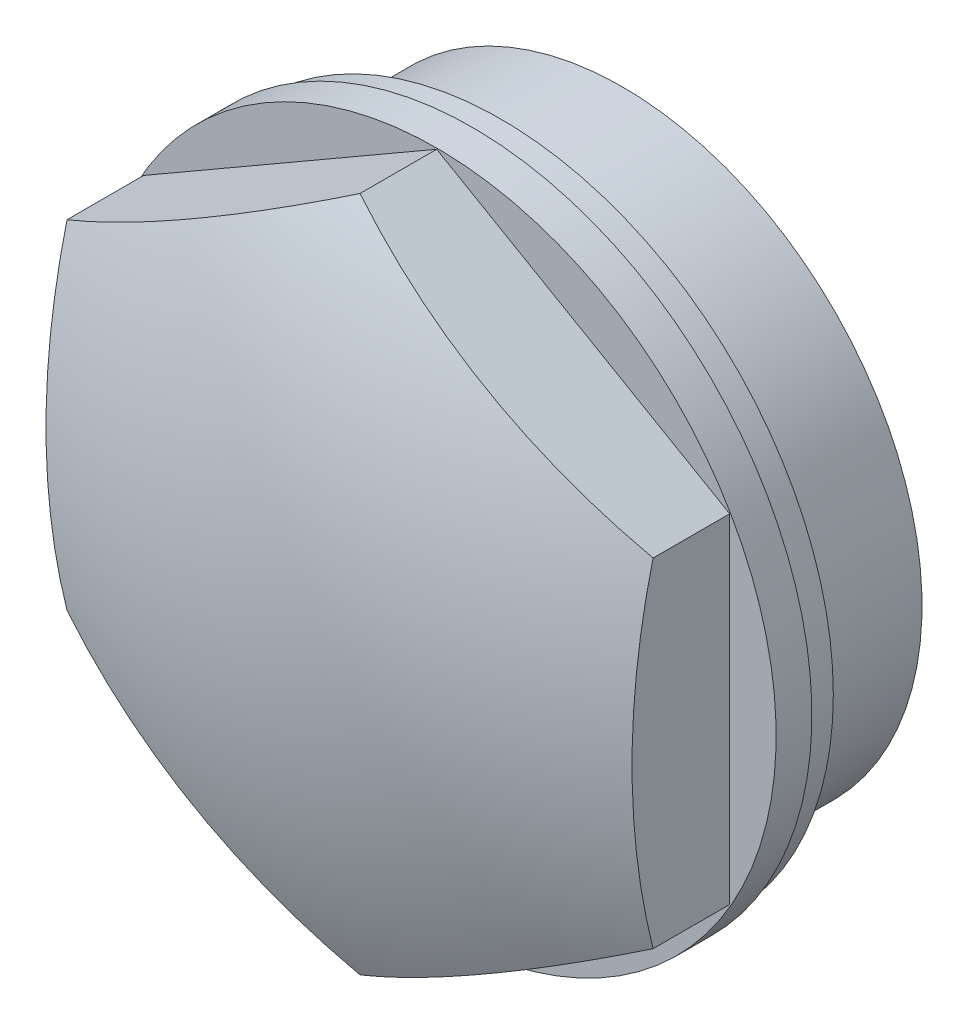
ISO-10303-21;
HEADER;
FILE_DESCRIPTION(('STEP AP214'),'2;1');
FILE_NAME('part.step','',(''),(''),'','','');
FILE_SCHEMA(('AUTOMOTIVE_DESIGN { 1 0 10303 214 1 1 1 1 }'));
ENDSEC;
DATA;
#1=APPLICATION_CONTEXT('core data for automotive mechanical design processes');
#2=APPLICATION_PROTOCOL_DEFINITION('international standard','automotive_design',2000,#1);
#3=PRODUCT_CONTEXT('',#1,'mechanical');
#4=PRODUCT('Part','Part','',(#3));
#5=PRODUCT_RELATED_PRODUCT_CATEGORY('part','',(#4));
#6=PRODUCT_DEFINITION_FORMATION('','',#4);
#7=PRODUCT_DEFINITION_CONTEXT('part definition',#1,'design');
#8=PRODUCT_DEFINITION('design','',#6,#7);
#9=PRODUCT_DEFINITION_SHAPE('','',#8);
#10=(LENGTH_UNIT() NAMED_UNIT(*) SI_UNIT(.MILLI.,.METRE.));
#11=(NAMED_UNIT(*) PLANE_ANGLE_UNIT() SI_UNIT($,.RADIAN.));
#12=(NAMED_UNIT(*) SI_UNIT($,.STERADIAN.) SOLID_ANGLE_UNIT());
#13=UNCERTAINTY_MEASURE_WITH_UNIT(LENGTH_MEASURE(1.E-05),#10,'distance_accuracy_value','');
#14=(GEOMETRIC_REPRESENTATION_CONTEXT(3) GLOBAL_UNCERTAINTY_ASSIGNED_CONTEXT((#13)) GLOBAL_UNIT_ASSIGNED_CONTEXT((#10,
#11,#12)) REPRESENTATION_CONTEXT('',''));
#15=CARTESIAN_POINT('',(0.,0.,0.));
#16=DIRECTION('',(0.,0.,1.));
#17=DIRECTION('',(1.,0.,0.));
#18=AXIS2_PLACEMENT_3D('',#15,#16,#17);
#19=CARTESIAN_POINT('',(0.,0.,-9.5));
#20=DIRECTION('',(0.,0.,-1.));
#21=DIRECTION('',(-1.,0.,0.));
#22=AXIS2_PLACEMENT_3D('',#19,#20,#21);
#23=PLANE('',#22);
#24=CARTESIAN_POINT('',(0.,0.,-9.5));
#25=DIRECTION('',(0.,0.,-1.));
#26=DIRECTION('',(-1.,0.,0.));
#27=AXIS2_PLACEMENT_3D('',#24,#25,#26);
#28=CIRCLE('',#27,19.476);
#29=CARTESIAN_POINT('',(-19.476,0.,-9.5));
#30=VERTEX_POINT('',#29);
#31=EDGE_CURVE('E124',#30,#30,#28,.T.);
#32=ORIENTED_EDGE('',*,*,#31,.T.);
#33=EDGE_LOOP('',(#32));
#34=FACE_BOUND('',#33,.T.);
#35=ADVANCED_FACE('F14',(#34),#23,.T.);
#36=CARTESIAN_POINT('',(0.,0.,-21.6670163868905));
#37=DIRECTION('',(0.,0.,-1.));
#38=DIRECTION('',(-1.,0.,0.));
#39=AXIS2_PLACEMENT_3D('',#36,#37,#38);
#40=CYLINDRICAL_SURFACE('',#39,19.476);
#41=ORIENTED_EDGE('',*,*,#31,.F.);
#42=EDGE_LOOP('',(#41));
#43=FACE_BOUND('',#42,.T.);
#44=CARTESIAN_POINT('',(0.,0.,-8.5));
#45=DIRECTION('',(0.,0.,-1.));
#46=DIRECTION('',(-1.,0.,0.));
#47=AXIS2_PLACEMENT_3D('',#44,#45,#46);
#48=CIRCLE('',#47,19.476);
#49=CARTESIAN_POINT('',(-19.476,0.,-8.5));
#50=VERTEX_POINT('',#49);
#51=EDGE_CURVE('E121',#50,#50,#48,.T.);
#52=ORIENTED_EDGE('',*,*,#51,.T.);
#53=EDGE_LOOP('',(#52));
#54=FACE_BOUND('',#53,.T.);
#55=ADVANCED_FACE('F161',(#43,#54),#40,.T.);
#56=CARTESIAN_POINT('',(0.,19.476,-8.5));
#57=DIRECTION('',(0.,0.,-1.));
#58=DIRECTION('',(-1.,0.,0.));
#59=AXIS2_PLACEMENT_3D('',#56,#57,#58);
#60=PLANE('',#59);
#61=CARTESIAN_POINT('',(0.,0.,-8.5));
#62=DIRECTION('',(0.,0.,-1.));
#63=DIRECTION('',(-1.,0.,0.));
#64=AXIS2_PLACEMENT_3D('',#61,#62,#63);
#65=CIRCLE('',#64,20.955);
#66=CARTESIAN_POINT('',(-20.955,0.,-8.5));
#67=VERTEX_POINT('',#66);
#68=EDGE_CURVE('E118',#67,#67,#65,.T.);
#69=ORIENTED_EDGE('',*,*,#68,.T.);
#70=EDGE_LOOP('',(#69));
#71=FACE_BOUND('',#70,.T.);
#72=ORIENTED_EDGE('',*,*,#51,.F.);
#73=EDGE_LOOP('',(#72));
#74=FACE_BOUND('',#73,.T.);
#75=ADVANCED_FACE('F167',(#71,#74),#60,.T.);
#76=CARTESIAN_POINT('',(0.,0.,-21.6670163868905));
#77=DIRECTION('',(0.,0.,-1.));
#78=DIRECTION('',(-1.,0.,0.));
#79=AXIS2_PLACEMENT_3D('',#76,#77,#78);
#80=CYLINDRICAL_SURFACE('',#79,20.955);
#81=ORIENTED_EDGE('',*,*,#68,.F.);
#82=EDGE_LOOP('',(#81));
#83=FACE_BOUND('',#82,.T.);
#84=CARTESIAN_POINT('',(0.,0.,0.));
#85=DIRECTION('',(0.,0.,-1.));
#86=DIRECTION('',(-1.,0.,0.));
#87=AXIS2_PLACEMENT_3D('',#84,#85,#86);
#88=CIRCLE('',#87,20.955);
#89=CARTESIAN_POINT('',(-20.955,0.,0.));
#90=VERTEX_POINT('',#89);
#91=EDGE_CURVE('E115',#90,#90,#88,.T.);
#92=ORIENTED_EDGE('',*,*,#91,.T.);
#93=EDGE_LOOP('',(#92));
#94=FACE_BOUND('',#93,.T.);
#95=ADVANCED_FACE('F174',(#83,#94),#80,.T.);
#96=CARTESIAN_POINT('',(0.,23.25,0.));
#97=DIRECTION('',(0.,0.,1.));
#98=DIRECTION('',(1.,0.,0.));
#99=AXIS2_PLACEMENT_3D('',#96,#97,#98);
#100=PLANE('',#99);
#101=ORIENTED_EDGE('',*,*,#91,.F.);
#102=EDGE_LOOP('',(#101));
#103=FACE_BOUND('',#102,.T.);
#104=CARTESIAN_POINT('',(0.,0.,0.));
#105=DIRECTION('',(0.,0.,-1.));
#106=DIRECTION('',(-1.,0.,0.));
#107=AXIS2_PLACEMENT_3D('',#104,#105,#106);
#108=CIRCLE('',#107,23.25);
#109=CARTESIAN_POINT('',(-23.25,0.,0.));
#110=VERTEX_POINT('',#109);
#111=EDGE_CURVE('E112',#110,#110,#108,.T.);
#112=ORIENTED_EDGE('',*,*,#111,.T.);
#113=EDGE_LOOP('',(#112));
#114=FACE_BOUND('',#113,.T.);
#115=ADVANCED_FACE('F181',(#103,#114),#100,.F.);
#116=CARTESIAN_POINT('',(0.,0.,-21.6670163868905));
#117=DIRECTION('',(0.,0.,-1.));
#118=DIRECTION('',(-1.,0.,0.));
#119=AXIS2_PLACEMENT_3D('',#116,#117,#118);
#120=CYLINDRICAL_SURFACE('',#119,23.25);
#121=CARTESIAN_POINT('',(0.,0.,2.));
#122=DIRECTION('',(0.,0.,-1.));
#123=DIRECTION('',(-1.,0.,0.));
#124=AXIS2_PLACEMENT_3D('',#121,#122,#123);
#125=CIRCLE('',#124,23.25);
#126=CARTESIAN_POINT('',(-23.25,0.,2.));
#127=VERTEX_POINT('',#126);
#128=EDGE_CURVE('E109',#127,#127,#125,.T.);
#129=ORIENTED_EDGE('',*,*,#128,.T.);
#130=EDGE_LOOP('',(#129));
#131=FACE_BOUND('',#130,.T.);
#132=ORIENTED_EDGE('',*,*,#111,.F.);
#133=EDGE_LOOP('',(#132));
#134=FACE_BOUND('',#133,.T.);
#135=ADVANCED_FACE('F187',(#131,#134),#120,.T.);
#136=CARTESIAN_POINT('',(0.,23.25,2.));
#137=DIRECTION('',(0.,0.,-1.));
#138=DIRECTION('',(-1.,0.,0.));
#139=AXIS2_PLACEMENT_3D('',#136,#137,#138);
#140=PLANE('',#139);
#141=CARTESIAN_POINT('',(0.,0.,2.));
#142=DIRECTION('',(0.,0.,-1.));
#143=DIRECTION('',(-1.,0.,0.));
#144=AXIS2_PLACEMENT_3D('',#141,#142,#143);
#145=CIRCLE('',#144,23.75);
#146=CARTESIAN_POINT('',(-23.75,0.,2.));
#147=VERTEX_POINT('',#146);
#148=EDGE_CURVE('E106',#147,#147,#145,.T.);
#149=ORIENTED_EDGE('',*,*,#148,.T.);
#150=EDGE_LOOP('',(#149));
#151=FACE_BOUND('',#150,.T.);
#152=ORIENTED_EDGE('',*,*,#128,.F.);
#153=EDGE_LOOP('',(#152));
#154=FACE_BOUND('',#153,.T.);
#155=ADVANCED_FACE('F191',(#151,#154),#140,.T.);
#156=CARTESIAN_POINT('',(0.,0.,-21.6670163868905));
#157=DIRECTION('',(0.,0.,-1.));
#158=DIRECTION('',(-1.,0.,0.));
#159=AXIS2_PLACEMENT_3D('',#156,#157,#158);
#160=CYLINDRICAL_SURFACE('',#159,23.75);
#161=ORIENTED_EDGE('',*,*,#148,.F.);
#162=EDGE_LOOP('',(#161));
#163=FACE_BOUND('',#162,.T.);
#164=CARTESIAN_POINT('',(0.,0.,4.5));
#165=DIRECTION('',(0.,0.,-1.));
#166=DIRECTION('',(-1.,0.,0.));
#167=AXIS2_PLACEMENT_3D('',#164,#165,#166);
#168=CIRCLE('',#167,23.75);
#169=CARTESIAN_POINT('',(-23.75,0.,4.5));
#170=VERTEX_POINT('',#169);
#171=EDGE_CURVE('E103',#170,#170,#168,.T.);
#172=ORIENTED_EDGE('',*,*,#171,.T.);
#173=EDGE_LOOP('',(#172));
#174=FACE_BOUND('',#173,.T.);
#175=ADVANCED_FACE('F195',(#163,#174),#160,.T.);
#176=CARTESIAN_POINT('',(0.,23.6713610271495,4.5));
#177=DIRECTION('',(0.,0.,-1.));
#178=DIRECTION('',(-1.,0.,0.));
#179=AXIS2_PLACEMENT_3D('',#176,#177,#178);
#180=PLANE('',#179);
#181=ORIENTED_EDGE('',*,*,#171,.F.);
#182=EDGE_LOOP('',(#181));
#183=FACE_BOUND('',#182,.T.);
#184=DIRECTION('',(0.,1.,0.));
#185=VECTOR('',#184,1.);
#186=CARTESIAN_POINT('',(-20.499999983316,-11.8356805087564,4.5));
#187=LINE('',#186,#185);
#188=CARTESIAN_POINT('',(-20.499999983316,-11.8356805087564,4.5));
#189=VERTEX_POINT('',#188);
#190=CARTESIAN_POINT('',(-20.499999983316,11.835680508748,4.5));
#191=VERTEX_POINT('',#190);
#192=EDGE_CURVE('E93',#189,#191,#187,.T.);
#193=ORIENTED_EDGE('',*,*,#192,.T.);
#194=DIRECTION('',(0.866025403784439,0.5,0.));
#195=VECTOR('',#194,1.);
#196=CARTESIAN_POINT('',(-20.499999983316,11.835680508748,4.5));
#197=LINE('',#196,#195);
#198=CARTESIAN_POINT('',(-7.9658502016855E-12,23.671361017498,4.5));
#199=VERTEX_POINT('',#198);
#200=EDGE_CURVE('E83',#191,#199,#197,.T.);
#201=ORIENTED_EDGE('',*,*,#200,.T.);
#202=DIRECTION('',(0.866025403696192,-0.500000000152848,0.));
#203=VECTOR('',#202,1.);
#204=CARTESIAN_POINT('',(-7.9658502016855E-12,23.671361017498,4.5));
#205=LINE('',#204,#203);
#206=CARTESIAN_POINT('',(20.4999999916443,11.835680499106,4.5));
#207=VERTEX_POINT('',#206);
#208=EDGE_CURVE('E68',#199,#207,#205,.T.);
#209=ORIENTED_EDGE('',*,*,#208,.T.);
#210=DIRECTION('',(0.,-1.,0.));
#211=VECTOR('',#210,1.);
#212=CARTESIAN_POINT('',(20.4999999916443,11.835680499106,4.5));
#213=LINE('',#212,#211);
#214=CARTESIAN_POINT('',(20.499999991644,-11.8356805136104,4.5));
#215=VERTEX_POINT('',#214);
#216=EDGE_CURVE('E80',#207,#215,#213,.T.);
#217=ORIENTED_EDGE('',*,*,#216,.T.);
#218=DIRECTION('',(-0.866025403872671,-0.499999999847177,0.));
#219=VECTOR('',#218,1.);
#220=CARTESIAN_POINT('',(20.4999999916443,-11.835680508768,4.5));
#221=LINE('',#220,#219);
#222=CARTESIAN_POINT('',(-2.92821322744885E-12,-23.6713610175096,4.5));
#223=VERTEX_POINT('',#222);
#224=EDGE_CURVE('E28',#215,#223,#221,.T.);
#225=ORIENTED_EDGE('',*,*,#224,.T.);
#226=DIRECTION('',(-0.866025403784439,0.5,0.));
#227=VECTOR('',#226,1.);
#228=CARTESIAN_POINT('',(-2.92821322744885E-12,-23.6713610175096,4.5));
#229=LINE('',#228,#227);
#230=EDGE_CURVE('E87',#223,#189,#229,.T.);
#231=ORIENTED_EDGE('',*,*,#230,.T.);
#232=EDGE_LOOP('',(#193,#201,#209,#217,#225,#231));
#233=FACE_BOUND('',#232,.T.);
#234=ADVANCED_FACE('F79',(#183,#233),#180,.F.);
#235=CARTESIAN_POINT('',(-20.499999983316,11.835680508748,15.5000000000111));
#236=DIRECTION('',(-0.5,0.866025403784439,0.));
#237=DIRECTION('',(0.866025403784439,0.5,0.));
#238=AXIS2_PLACEMENT_3D('',#235,#236,#237);
#239=PLANE('',#238);
#240=DIRECTION('',(0.,0.,-1.));
#241=VECTOR('',#240,1.);
#242=CARTESIAN_POINT('',(-7.9658502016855E-12,23.671361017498,15.5000000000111));
#243=LINE('',#242,#241);
#244=CARTESIAN_POINT('',(-1.67262374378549E-08,23.6713610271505,9.86060890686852));
#245=VERTEX_POINT('',#244);
#246=EDGE_CURVE('E36',#245,#199,#243,.T.);
#247=ORIENTED_EDGE('',*,*,#246,.T.);
#248=ORIENTED_EDGE('',*,*,#200,.F.);
#249=DIRECTION('',(0.,0.,-1.));
#250=VECTOR('',#249,1.);
#251=CARTESIAN_POINT('',(-20.499999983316,11.835680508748,15.5000000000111));
#252=LINE('',#251,#250);
#253=CARTESIAN_POINT('',(-20.499999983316,11.835680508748,9.86060891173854));
#254=VERTEX_POINT('',#253);
#255=EDGE_CURVE('E101',#254,#191,#252,.T.);
#256=ORIENTED_EDGE('',*,*,#255,.F.);
#257=CARTESIAN_POINT('',(-10.2499999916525,17.7535207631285,-36.999999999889));
#258=DIRECTION('',(-0.5,0.866025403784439,0.));
#259=DIRECTION('',(0.866025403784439,0.5,0.));
#260=AXIS2_PLACEMENT_3D('',#257,#258,#259);
#261=CIRCLE('',#260,48.3321839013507);
#262=EDGE_CURVE('E9',#245,#254,#261,.F.);
#263=ORIENTED_EDGE('',*,*,#262,.F.);
#264=EDGE_LOOP('',(#247,#248,#256,#263));
#265=FACE_BOUND('',#264,.T.);
#266=ADVANCED_FACE('F144',(#265),#239,.T.);
#267=CARTESIAN_POINT('',(-20.499999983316,-11.8356805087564,15.5000000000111));
#268=DIRECTION('',(-1.,0.,0.));
#269=DIRECTION('',(0.,0.,1.));
#270=AXIS2_PLACEMENT_3D('',#267,#268,#269);
#271=PLANE('',#270);
#272=ORIENTED_EDGE('',*,*,#255,.T.);
#273=ORIENTED_EDGE('',*,*,#192,.F.);
#274=DIRECTION('',(0.,0.,-1.));
#275=VECTOR('',#274,1.);
#276=CARTESIAN_POINT('',(-20.499999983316,-11.8356805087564,15.5000000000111));
#277=LINE('',#276,#275);
#278=CARTESIAN_POINT('',(-20.499999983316,-11.8356805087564,9.86060891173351));
#279=VERTEX_POINT('',#278);
#280=EDGE_CURVE('E99',#279,#189,#277,.T.);
#281=ORIENTED_EDGE('',*,*,#280,.F.);
#282=CARTESIAN_POINT('',(-20.499999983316,5.60662627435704E-12,-36.999999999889));
#283=DIRECTION('',(-1.,0.,0.));
#284=DIRECTION('',(0.,0.,1.));
#285=AXIS2_PLACEMENT_3D('',#282,#283,#284);
#286=CIRCLE('',#285,48.332183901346);
#287=EDGE_CURVE('E21',#254,#279,#286,.F.);
#288=ORIENTED_EDGE('',*,*,#287,.F.);
#289=EDGE_LOOP('',(#272,#273,#281,#288));
#290=FACE_BOUND('',#289,.T.);
#291=ADVANCED_FACE('F141',(#290),#271,.T.);
#292=CARTESIAN_POINT('',(-2.92821322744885E-12,-23.6713610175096,15.5000000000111));
#293=DIRECTION('',(-0.5,-0.866025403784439,0.));
#294=DIRECTION('',(-0.866025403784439,0.5,0.));
#295=AXIS2_PLACEMENT_3D('',#292,#293,#294);
#296=PLANE('',#295);
#297=ORIENTED_EDGE('',*,*,#280,.T.);
#298=ORIENTED_EDGE('',*,*,#230,.F.);
#299=DIRECTION('',(0.,0.,-1.));
#300=VECTOR('',#299,1.);
#301=CARTESIAN_POINT('',(-2.92821322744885E-12,-23.6713610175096,15.5000000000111));
#302=LINE('',#301,#300);
#303=CARTESIAN_POINT('',(-2.92647850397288E-12,-23.6713610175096,9.86060891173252));
#304=VERTEX_POINT('',#303);
#305=EDGE_CURVE('E97',#304,#223,#302,.T.);
#306=ORIENTED_EDGE('',*,*,#305,.F.);
#307=CARTESIAN_POINT('',(-10.2499999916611,-17.753520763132,-36.999999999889));
#308=DIRECTION('',(-0.5,-0.866025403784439,0.));
#309=DIRECTION('',(-0.866025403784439,0.5,0.));
#310=AXIS2_PLACEMENT_3D('',#307,#308,#309);
#311=CIRCLE('',#310,48.3321839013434);
#312=EDGE_CURVE('E133',#279,#304,#311,.F.);
#313=ORIENTED_EDGE('',*,*,#312,.F.);
#314=EDGE_LOOP('',(#297,#298,#306,#313));
#315=FACE_BOUND('',#314,.T.);
#316=ADVANCED_FACE('F149',(#315),#296,.T.);
#317=CARTESIAN_POINT('',(20.4999999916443,-11.835680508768,15.5000000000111));
#318=DIRECTION('',(0.499999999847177,-0.866025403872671,0.));
#319=DIRECTION('',(-0.866025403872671,-0.499999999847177,0.));
#320=AXIS2_PLACEMENT_3D('',#317,#318,#319);
#321=PLANE('',#320);
#322=ORIENTED_EDGE('',*,*,#305,.T.);
#323=ORIENTED_EDGE('',*,*,#224,.F.);
#324=DIRECTION('',(0.,0.,-1.));
#325=VECTOR('',#324,1.);
#326=CARTESIAN_POINT('',(20.4999999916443,-11.835680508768,15.5000000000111));
#327=LINE('',#326,#325);
#328=CARTESIAN_POINT('',(20.4999999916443,-11.835680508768,9.86060890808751));
#329=VERTEX_POINT('',#328);
#330=EDGE_CURVE('E74',#329,#215,#327,.T.);
#331=ORIENTED_EDGE('',*,*,#330,.F.);
#332=CARTESIAN_POINT('',(10.249999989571,-17.753520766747,-36.999999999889));
#333=DIRECTION('',(0.499999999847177,-0.866025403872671,0.));
#334=DIRECTION('',(-0.866025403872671,-0.499999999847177,0.));
#335=AXIS2_PLACEMENT_3D('',#332,#333,#334);
#336=CIRCLE('',#335,48.3321839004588);
#337=EDGE_CURVE('E130',#304,#329,#336,.F.);
#338=ORIENTED_EDGE('',*,*,#337,.F.);
#339=EDGE_LOOP('',(#322,#323,#331,#338));
#340=FACE_BOUND('',#339,.T.);
#341=ADVANCED_FACE('F145',(#340),#321,.T.);
#342=CARTESIAN_POINT('',(20.4999999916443,11.835680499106,15.5000000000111));
#343=DIRECTION('',(1.,0.,0.));
#344=DIRECTION('',(0.,0.,-1.));
#345=AXIS2_PLACEMENT_3D('',#342,#343,#344);
#346=PLANE('',#345);
#347=ORIENTED_EDGE('',*,*,#330,.T.);
#348=ORIENTED_EDGE('',*,*,#216,.F.);
#349=DIRECTION('',(0.,0.,-1.));
#350=VECTOR('',#349,1.);
#351=CARTESIAN_POINT('',(20.4999999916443,11.835680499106,15.5000000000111));
#352=LINE('',#351,#350);
#353=CARTESIAN_POINT('',(20.4999999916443,11.835680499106,9.86060891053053));
#354=VERTEX_POINT('',#353);
#355=EDGE_CURVE('E65',#354,#207,#352,.T.);
#356=ORIENTED_EDGE('',*,*,#355,.F.);
#357=CARTESIAN_POINT('',(20.4999999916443,5.60662627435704E-12,-36.999999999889));
#358=DIRECTION('',(1.,0.,0.));
#359=DIRECTION('',(0.,0.,-1.));
#360=AXIS2_PLACEMENT_3D('',#357,#358,#359);
#361=CIRCLE('',#360,48.3321838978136);
#362=EDGE_CURVE('E128',#329,#354,#361,.F.);
#363=ORIENTED_EDGE('',*,*,#362,.F.);
#364=EDGE_LOOP('',(#347,#348,#356,#363));
#365=FACE_BOUND('',#364,.T.);
#366=ADVANCED_FACE('F85',(#365),#346,.T.);
#367=CARTESIAN_POINT('',(-7.9658502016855E-12,23.671361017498,15.5000000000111));
#368=DIRECTION('',(0.500000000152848,0.866025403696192,0.));
#369=DIRECTION('',(0.866025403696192,-0.500000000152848,0.));
#370=AXIS2_PLACEMENT_3D('',#367,#368,#369);
#371=PLANE('',#370);
#372=ORIENTED_EDGE('',*,*,#355,.T.);
#373=ORIENTED_EDGE('',*,*,#208,.F.);
#374=ORIENTED_EDGE('',*,*,#246,.F.);
#375=CARTESIAN_POINT('',(10.2499999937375,17.7535207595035,-36.999999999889));
#376=DIRECTION('',(0.500000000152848,0.866025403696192,0.));
#377=DIRECTION('',(0.866025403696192,-0.500000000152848,0.));
#378=AXIS2_PLACEMENT_3D('',#375,#376,#377);
#379=CIRCLE('',#378,48.3321839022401);
#380=EDGE_CURVE('E70',#354,#245,#379,.F.);
#381=ORIENTED_EDGE('',*,*,#380,.F.);
#382=EDGE_LOOP('',(#372,#373,#374,#381));
#383=FACE_BOUND('',#382,.T.);
#384=ADVANCED_FACE('F67',(#383),#371,.T.);
#385=CARTESIAN_POINT('',(0.,5.60662627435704E-12,-36.999999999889));
#386=DIRECTION('',(1.,0.,0.));
#387=DIRECTION('',(0.,0.,-1.));
#388=AXIS2_PLACEMENT_3D('',#385,#386,#387);
#389=SPHERICAL_SURFACE('',#388,52.4999999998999);
#390=ORIENTED_EDGE('',*,*,#380,.T.);
#391=ORIENTED_EDGE('',*,*,#262,.T.);
#392=ORIENTED_EDGE('',*,*,#287,.T.);
#393=ORIENTED_EDGE('',*,*,#312,.T.);
#394=ORIENTED_EDGE('',*,*,#337,.T.);
#395=ORIENTED_EDGE('',*,*,#362,.T.);
#396=EDGE_LOOP('',(#390,#391,#392,#393,#394,#395));
#397=FACE_BOUND('',#396,.T.);
#398=ADVANCED_FACE('F137',(#397),#389,.T.);
#399=CLOSED_SHELL('',(#35,#55,#75,#95,#115,#135,#155,#175,#234,#266,#291,#316,#341,#366,#384,#398));
#400=MANIFOLD_SOLID_BREP('B1',#399);
#401=ADVANCED_BREP_SHAPE_REPRESENTATION('',(#18,#400),#14);
#402=SHAPE_DEFINITION_REPRESENTATION(#9,#401);
ENDSEC;
END-ISO-10303-21;
